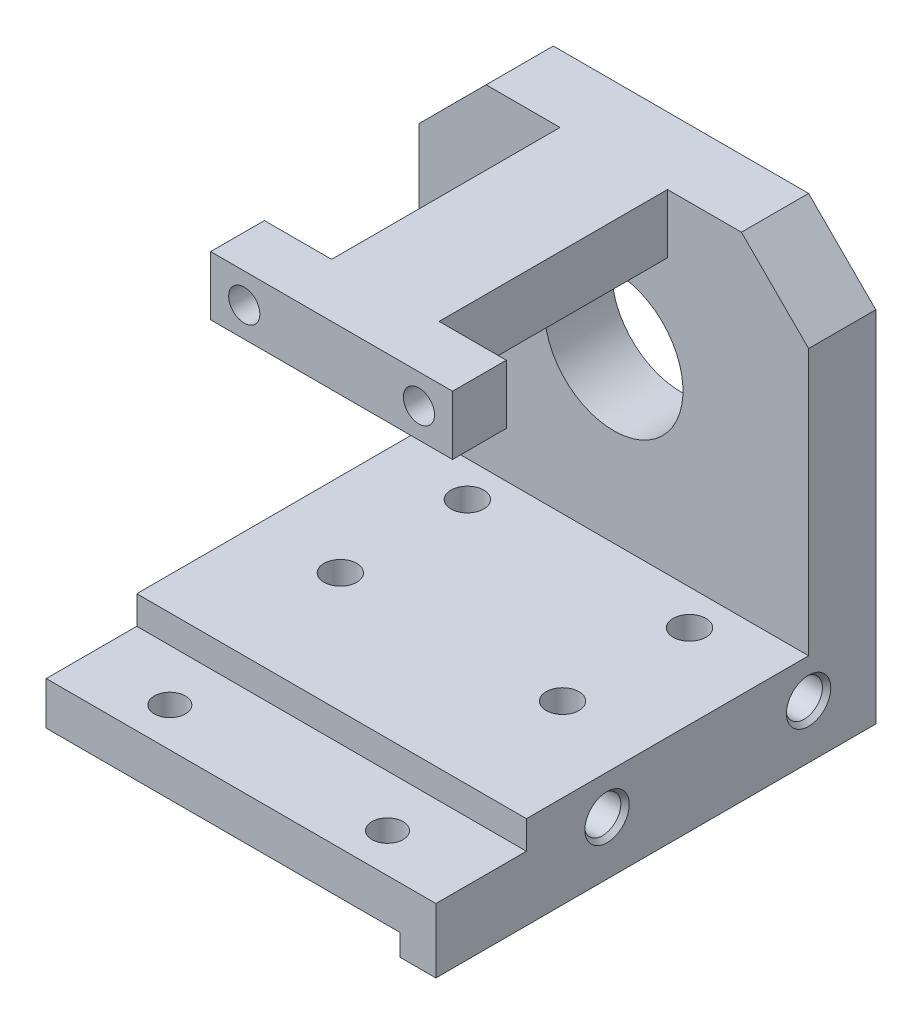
ISO-10303-21;
HEADER;
FILE_DESCRIPTION(('STEP AP214'),'2;1');
FILE_NAME('part.step','',(''),(''),'','','');
FILE_SCHEMA(('AUTOMOTIVE_DESIGN { 1 0 10303 214 1 1 1 1 }'));
ENDSEC;
DATA;
#1=APPLICATION_CONTEXT('core data for automotive mechanical design processes');
#2=APPLICATION_PROTOCOL_DEFINITION('international standard','automotive_design',2000,#1);
#3=PRODUCT_CONTEXT('',#1,'mechanical');
#4=PRODUCT('Part','Part','',(#3));
#5=PRODUCT_RELATED_PRODUCT_CATEGORY('part','',(#4));
#6=PRODUCT_DEFINITION_FORMATION('','',#4);
#7=PRODUCT_DEFINITION_CONTEXT('part definition',#1,'design');
#8=PRODUCT_DEFINITION('design','',#6,#7);
#9=PRODUCT_DEFINITION_SHAPE('','',#8);
#10=(LENGTH_UNIT() NAMED_UNIT(*) SI_UNIT(.MILLI.,.METRE.));
#11=(NAMED_UNIT(*) PLANE_ANGLE_UNIT() SI_UNIT($,.RADIAN.));
#12=(NAMED_UNIT(*) SI_UNIT($,.STERADIAN.) SOLID_ANGLE_UNIT());
#13=UNCERTAINTY_MEASURE_WITH_UNIT(LENGTH_MEASURE(1.E-05),#10,'distance_accuracy_value','');
#14=(GEOMETRIC_REPRESENTATION_CONTEXT(3) GLOBAL_UNCERTAINTY_ASSIGNED_CONTEXT((#13)) GLOBAL_UNIT_ASSIGNED_CONTEXT((#10,
#11,#12)) REPRESENTATION_CONTEXT('',''));
#15=CARTESIAN_POINT('',(0.,0.,0.));
#16=DIRECTION('',(0.,0.,1.));
#17=DIRECTION('',(1.,0.,0.));
#18=AXIS2_PLACEMENT_3D('',#15,#16,#17);
#19=CARTESIAN_POINT('',(0.,0.,0.254000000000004));
#20=DIRECTION('',(0.,0.,-1.));
#21=DIRECTION('',(-1.,0.,0.));
#22=AXIS2_PLACEMENT_3D('',#19,#20,#21);
#23=PLANE('',#22);
#24=CARTESIAN_POINT('',(0.,0.,0.254000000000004));
#25=DIRECTION('',(0.,0.,-1.));
#26=DIRECTION('',(-1.,0.,0.));
#27=AXIS2_PLACEMENT_3D('',#24,#25,#26);
#28=CIRCLE('',#27,13.97);
#29=CARTESIAN_POINT('',(-13.97,0.,0.254000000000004));
#30=VERTEX_POINT('',#29);
#31=EDGE_CURVE('E906',#30,#30,#28,.T.);
#32=ORIENTED_EDGE('',*,*,#31,.T.);
#33=EDGE_LOOP('',(#32));
#34=FACE_BOUND('',#33,.T.);
#35=CARTESIAN_POINT('',(0.,0.,0.254000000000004));
#36=DIRECTION('',(0.,0.,-1.));
#37=DIRECTION('',(-1.,0.,0.));
#38=AXIS2_PLACEMENT_3D('',#35,#36,#37);
#39=CIRCLE('',#38,7.9375);
#40=CARTESIAN_POINT('',(-7.9375,0.,0.254000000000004));
#41=VERTEX_POINT('',#40);
#42=EDGE_CURVE('E912',#41,#41,#39,.T.);
#43=ORIENTED_EDGE('',*,*,#42,.F.);
#44=EDGE_LOOP('',(#43));
#45=FACE_BOUND('',#44,.T.);
#46=ADVANCED_FACE('F37',(#34,#45),#23,.T.);
#47=CARTESIAN_POINT('',(0.,0.,6.35));
#48=DIRECTION('',(0.,0.,-1.));
#49=DIRECTION('',(-1.,0.,0.));
#50=AXIS2_PLACEMENT_3D('',#47,#48,#49);
#51=CYLINDRICAL_SURFACE('',#50,6.5405);
#52=CARTESIAN_POINT('',(0.,0.,6.35));
#53=DIRECTION('',(0.,0.,-1.));
#54=DIRECTION('',(-1.,0.,0.));
#55=AXIS2_PLACEMENT_3D('',#52,#53,#54);
#56=CIRCLE('',#55,6.5405);
#57=CARTESIAN_POINT('',(-6.5405,0.,6.35));
#58=VERTEX_POINT('',#57);
#59=EDGE_CURVE('E222',#58,#58,#56,.T.);
#60=ORIENTED_EDGE('',*,*,#59,.F.);
#61=EDGE_LOOP('',(#60));
#62=FACE_BOUND('',#61,.T.);
#63=CARTESIAN_POINT('',(0.,0.,0.));
#64=DIRECTION('',(0.,0.,-1.));
#65=DIRECTION('',(-1.,0.,0.));
#66=AXIS2_PLACEMENT_3D('',#63,#64,#65);
#67=CIRCLE('',#66,6.5405);
#68=CARTESIAN_POINT('',(-6.5405,0.,0.));
#69=VERTEX_POINT('',#68);
#70=EDGE_CURVE('E915',#69,#69,#67,.T.);
#71=ORIENTED_EDGE('',*,*,#70,.T.);
#72=EDGE_LOOP('',(#71));
#73=FACE_BOUND('',#72,.T.);
#74=ADVANCED_FACE('F430',(#62,#73),#51,.F.);
#75=CARTESIAN_POINT('',(-5.08,15.748,44.6153156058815));
#76=DIRECTION('',(1.,0.,0.));
#77=DIRECTION('',(0.,1.,0.));
#78=AXIS2_PLACEMENT_3D('',#75,#76,#77);
#79=PLANE('',#78);
#80=DIRECTION('',(0.,-1.,0.));
#81=VECTOR('',#80,1.);
#82=CARTESIAN_POINT('',(-5.08,15.748,27.94));
#83=LINE('',#82,#81);
#84=CARTESIAN_POINT('',(-5.08,15.748,27.94));
#85=VERTEX_POINT('',#84);
#86=CARTESIAN_POINT('',(-5.08,10.16,27.94));
#87=VERTEX_POINT('',#86);
#88=EDGE_CURVE('E368',#85,#87,#83,.T.);
#89=ORIENTED_EDGE('',*,*,#88,.F.);
#90=DIRECTION('',(0.,0.,-1.));
#91=VECTOR('',#90,1.);
#92=CARTESIAN_POINT('',(-5.08,15.748,44.6153156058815));
#93=LINE('',#92,#91);
#94=CARTESIAN_POINT('',(-5.08,15.748,6.34999999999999));
#95=VERTEX_POINT('',#94);
#96=EDGE_CURVE('E395',#85,#95,#93,.T.);
#97=ORIENTED_EDGE('',*,*,#96,.T.);
#98=DIRECTION('',(0.,-1.,0.));
#99=VECTOR('',#98,1.);
#100=CARTESIAN_POINT('',(-5.08,15.748,6.34999999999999));
#101=LINE('',#100,#99);
#102=CARTESIAN_POINT('',(-5.08,10.16,6.35));
#103=VERTEX_POINT('',#102);
#104=EDGE_CURVE('E285',#95,#103,#101,.T.);
#105=ORIENTED_EDGE('',*,*,#104,.T.);
#106=DIRECTION('',(0.,0.,-1.));
#107=VECTOR('',#106,1.);
#108=CARTESIAN_POINT('',(-5.08,10.16,44.6153156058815));
#109=LINE('',#108,#107);
#110=EDGE_CURVE('E400',#87,#103,#109,.T.);
#111=ORIENTED_EDGE('',*,*,#110,.F.);
#112=EDGE_LOOP('',(#89,#97,#105,#111));
#113=FACE_BOUND('',#112,.T.);
#114=ADVANCED_FACE('F428',(#113),#79,.F.);
#115=CARTESIAN_POINT('',(-18.415,15.748,6.34999999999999));
#116=DIRECTION('',(0.,0.,1.));
#117=DIRECTION('',(1.,0.,0.));
#118=AXIS2_PLACEMENT_3D('',#115,#116,#117);
#119=PLANE('',#118);
#120=ORIENTED_EDGE('',*,*,#59,.T.);
#121=EDGE_LOOP('',(#120));
#122=FACE_BOUND('',#121,.T.);
#123=DIRECTION('',(0.,1.,0.));
#124=VECTOR('',#123,1.);
#125=CARTESIAN_POINT('',(18.415,15.748,6.35));
#126=LINE('',#125,#124);
#127=CARTESIAN_POINT('',(18.415,-15.748,6.34999999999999));
#128=VERTEX_POINT('',#127);
#129=CARTESIAN_POINT('',(18.415,9.39799999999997,6.34999999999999));
#130=VERTEX_POINT('',#129);
#131=EDGE_CURVE('E229',#128,#130,#126,.T.);
#132=ORIENTED_EDGE('',*,*,#131,.T.);
#133=DIRECTION('',(0.707106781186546,-0.707106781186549,0.));
#134=VECTOR('',#133,1.);
#135=CARTESIAN_POINT('',(-3.17499999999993,30.988,6.34999999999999));
#136=LINE('',#135,#134);
#137=CARTESIAN_POINT('',(12.065,15.748,6.35));
#138=VERTEX_POINT('',#137);
#139=EDGE_CURVE('E290',#130,#138,#136,.F.);
#140=ORIENTED_EDGE('',*,*,#139,.T.);
#141=DIRECTION('',(-1.,0.,0.));
#142=VECTOR('',#141,1.);
#143=CARTESIAN_POINT('',(-18.415,15.748,6.34999999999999));
#144=LINE('',#143,#142);
#145=CARTESIAN_POINT('',(5.08,15.748,6.35));
#146=VERTEX_POINT('',#145);
#147=EDGE_CURVE('E274',#138,#146,#144,.T.);
#148=ORIENTED_EDGE('',*,*,#147,.T.);
#149=DIRECTION('',(0.,1.,0.));
#150=VECTOR('',#149,1.);
#151=CARTESIAN_POINT('',(5.08,15.748,6.35));
#152=LINE('',#151,#150);
#153=CARTESIAN_POINT('',(5.08,10.16,6.34999999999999));
#154=VERTEX_POINT('',#153);
#155=EDGE_CURVE('E392',#154,#146,#152,.T.);
#156=ORIENTED_EDGE('',*,*,#155,.F.);
#157=DIRECTION('',(1.,0.,0.));
#158=VECTOR('',#157,1.);
#159=CARTESIAN_POINT('',(-5.08,10.16,6.35));
#160=LINE('',#159,#158);
#161=EDGE_CURVE('E389',#103,#154,#160,.T.);
#162=ORIENTED_EDGE('',*,*,#161,.F.);
#163=ORIENTED_EDGE('',*,*,#104,.F.);
#164=CARTESIAN_POINT('',(-12.065,15.748,6.34999999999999));
#165=VERTEX_POINT('',#164);
#166=EDGE_CURVE('E266',#95,#165,#144,.T.);
#167=ORIENTED_EDGE('',*,*,#166,.T.);
#168=DIRECTION('',(0.707106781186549,0.707106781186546,0.));
#169=VECTOR('',#168,1.);
#170=CARTESIAN_POINT('',(-15.24,12.573,6.34999999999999));
#171=LINE('',#170,#169);
#172=CARTESIAN_POINT('',(-18.415,9.39799999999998,6.35));
#173=VERTEX_POINT('',#172);
#174=EDGE_CURVE('E61',#165,#173,#171,.F.);
#175=ORIENTED_EDGE('',*,*,#174,.T.);
#176=DIRECTION('',(0.,-1.,0.));
#177=VECTOR('',#176,1.);
#178=CARTESIAN_POINT('',(-18.415,15.748,6.34999999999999));
#179=LINE('',#178,#177);
#180=CARTESIAN_POINT('',(-18.415,-15.748,6.35));
#181=VERTEX_POINT('',#180);
#182=EDGE_CURVE('E258',#173,#181,#179,.T.);
#183=ORIENTED_EDGE('',*,*,#182,.T.);
#184=DIRECTION('',(-1.,0.,0.));
#185=VECTOR('',#184,1.);
#186=CARTESIAN_POINT('',(-18.415,-15.748,6.35));
#187=LINE('',#186,#185);
#188=EDGE_CURVE('E219',#128,#181,#187,.T.);
#189=ORIENTED_EDGE('',*,*,#188,.F.);
#190=EDGE_LOOP('',(#132,#140,#148,#156,#162,#163,#167,#175,#183,#189));
#191=FACE_BOUND('',#190,.T.);
#192=ADVANCED_FACE('F282',(#122,#191),#119,.T.);
#193=CARTESIAN_POINT('',(-18.415,-22.479,6.34999999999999));
#194=DIRECTION('',(0.,1.,0.));
#195=DIRECTION('',(-1.,0.,0.));
#196=AXIS2_PLACEMENT_3D('',#193,#194,#195);
#197=PLANE('',#196);
#198=CARTESIAN_POINT('',(10.500000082,-22.479,9.689999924));
#199=DIRECTION('',(0.,1.,0.));
#200=DIRECTION('',(-1.,0.,0.));
#201=AXIS2_PLACEMENT_3D('',#198,#199,#200);
#202=CIRCLE('',#201,1.54999999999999);
#203=CARTESIAN_POINT('',(8.95000008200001,-22.479,9.689999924));
#204=VERTEX_POINT('',#203);
#205=EDGE_CURVE('E855',#204,#204,#202,.T.);
#206=ORIENTED_EDGE('',*,*,#205,.T.);
#207=EDGE_LOOP('',(#206));
#208=FACE_BOUND('',#207,.T.);
#209=CARTESIAN_POINT('',(-10.500000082,-22.479,9.68999992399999));
#210=DIRECTION('',(0.,1.,0.));
#211=DIRECTION('',(-1.,0.,0.));
#212=AXIS2_PLACEMENT_3D('',#209,#210,#211);
#213=CIRCLE('',#212,1.54999999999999);
#214=CARTESIAN_POINT('',(-12.050000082,-22.479,9.68999992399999));
#215=VERTEX_POINT('',#214);
#216=EDGE_CURVE('E861',#215,#215,#213,.T.);
#217=ORIENTED_EDGE('',*,*,#216,.T.);
#218=EDGE_LOOP('',(#217));
#219=FACE_BOUND('',#218,.T.);
#220=CARTESIAN_POINT('',(-10.500000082,-22.479,21.690000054));
#221=DIRECTION('',(0.,1.,0.));
#222=DIRECTION('',(-1.,0.,0.));
#223=AXIS2_PLACEMENT_3D('',#220,#221,#222);
#224=CIRCLE('',#223,1.54999999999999);
#225=CARTESIAN_POINT('',(-12.050000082,-22.479,21.690000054));
#226=VERTEX_POINT('',#225);
#227=EDGE_CURVE('E325',#226,#226,#224,.T.);
#228=ORIENTED_EDGE('',*,*,#227,.T.);
#229=EDGE_LOOP('',(#228));
#230=FACE_BOUND('',#229,.T.);
#231=CARTESIAN_POINT('',(10.500000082,-22.479,21.690000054));
#232=DIRECTION('',(0.,1.,0.));
#233=DIRECTION('',(-1.,0.,0.));
#234=AXIS2_PLACEMENT_3D('',#231,#232,#233);
#235=CIRCLE('',#234,1.54999999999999);
#236=CARTESIAN_POINT('',(8.95000008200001,-22.479,21.690000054));
#237=VERTEX_POINT('',#236);
#238=EDGE_CURVE('E315',#237,#237,#235,.T.);
#239=ORIENTED_EDGE('',*,*,#238,.T.);
#240=EDGE_LOOP('',(#239));
#241=FACE_BOUND('',#240,.T.);
#242=CARTESIAN_POINT('',(10.16,-22.479,37.8943997));
#243=DIRECTION('',(0.,-1.,0.));
#244=DIRECTION('',(0.,0.,-1.));
#245=AXIS2_PLACEMENT_3D('',#242,#243,#244);
#246=CIRCLE('',#245,1.4732);
#247=CARTESIAN_POINT('',(10.16,-22.479,36.4211997));
#248=VERTEX_POINT('',#247);
#249=EDGE_CURVE('E317',#248,#248,#246,.T.);
#250=ORIENTED_EDGE('',*,*,#249,.F.);
#251=EDGE_LOOP('',(#250));
#252=FACE_BOUND('',#251,.T.);
#253=CARTESIAN_POINT('',(-10.414,-22.479,37.8943997));
#254=DIRECTION('',(0.,-1.,0.));
#255=DIRECTION('',(0.,0.,-1.));
#256=AXIS2_PLACEMENT_3D('',#253,#254,#255);
#257=CIRCLE('',#256,1.4732);
#258=CARTESIAN_POINT('',(-10.414,-22.479,36.4211997));
#259=VERTEX_POINT('',#258);
#260=EDGE_CURVE('E314',#259,#259,#257,.T.);
#261=ORIENTED_EDGE('',*,*,#260,.F.);
#262=EDGE_LOOP('',(#261));
#263=FACE_BOUND('',#262,.T.);
#264=DIRECTION('',(0.,0.,-1.));
#265=VECTOR('',#264,1.);
#266=CARTESIAN_POINT('',(14.999999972,-22.479,0.));
#267=LINE('',#266,#265);
#268=CARTESIAN_POINT('',(14.999999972,-22.479,41.5773997));
#269=VERTEX_POINT('',#268);
#270=CARTESIAN_POINT('',(14.999999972,-22.479,0.));
#271=VERTEX_POINT('',#270);
#272=EDGE_CURVE('E41',#269,#271,#267,.T.);
#273=ORIENTED_EDGE('',*,*,#272,.F.);
#274=DIRECTION('',(-1.,0.,0.));
#275=VECTOR('',#274,1.);
#276=CARTESIAN_POINT('',(-18.415,-22.479,41.5773997));
#277=LINE('',#276,#275);
#278=CARTESIAN_POINT('',(-18.415,-22.479,41.5773997));
#279=VERTEX_POINT('',#278);
#280=EDGE_CURVE('E849',#269,#279,#277,.T.);
#281=ORIENTED_EDGE('',*,*,#280,.T.);
#282=DIRECTION('',(0.,0.,1.));
#283=VECTOR('',#282,1.);
#284=CARTESIAN_POINT('',(-18.415,-22.479,6.34999999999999));
#285=LINE('',#284,#283);
#286=CARTESIAN_POINT('',(-18.415,-22.479,0.));
#287=VERTEX_POINT('',#286);
#288=EDGE_CURVE('E313',#287,#279,#285,.T.);
#289=ORIENTED_EDGE('',*,*,#288,.F.);
#290=DIRECTION('',(1.,0.,0.));
#291=VECTOR('',#290,1.);
#292=CARTESIAN_POINT('',(-18.415,-22.479,0.));
#293=LINE('',#292,#291);
#294=EDGE_CURVE('E244',#287,#271,#293,.T.);
#295=ORIENTED_EDGE('',*,*,#294,.T.);
#296=EDGE_LOOP('',(#273,#281,#289,#295));
#297=FACE_BOUND('',#296,.T.);
#298=ADVANCED_FACE('F436',(#208,#219,#230,#241,#252,#263,#297),#197,.F.);
#299=CARTESIAN_POINT('',(-18.415,15.748,0.));
#300=DIRECTION('',(0.,0.,1.));
#301=DIRECTION('',(1.,0.,0.));
#302=AXIS2_PLACEMENT_3D('',#299,#300,#301);
#303=PLANE('',#302);
#304=CARTESIAN_POINT('',(0.,0.,0.));
#305=DIRECTION('',(0.,0.,-1.));
#306=DIRECTION('',(-1.,0.,0.));
#307=AXIS2_PLACEMENT_3D('',#304,#305,#306);
#308=CIRCLE('',#307,13.97);
#309=CARTESIAN_POINT('',(-13.97,0.,0.));
#310=VERTEX_POINT('',#309);
#311=EDGE_CURVE('E907',#310,#310,#308,.T.);
#312=ORIENTED_EDGE('',*,*,#311,.F.);
#313=EDGE_LOOP('',(#312));
#314=FACE_BOUND('',#313,.T.);
#315=ORIENTED_EDGE('',*,*,#294,.F.);
#316=DIRECTION('',(0.,-1.,0.));
#317=VECTOR('',#316,1.);
#318=CARTESIAN_POINT('',(-18.415,15.748,0.));
#319=LINE('',#318,#317);
#320=CARTESIAN_POINT('',(-18.415,9.39799999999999,0.));
#321=VERTEX_POINT('',#320);
#322=EDGE_CURVE('E249',#321,#287,#319,.T.);
#323=ORIENTED_EDGE('',*,*,#322,.F.);
#324=DIRECTION('',(-0.707106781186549,-0.707106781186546,0.));
#325=VECTOR('',#324,1.);
#326=CARTESIAN_POINT('',(-18.415,9.39799999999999,0.));
#327=LINE('',#326,#325);
#328=CARTESIAN_POINT('',(-12.065,15.748,0.));
#329=VERTEX_POINT('',#328);
#330=EDGE_CURVE('E294',#321,#329,#327,.F.);
#331=ORIENTED_EDGE('',*,*,#330,.T.);
#332=DIRECTION('',(-1.,0.,0.));
#333=VECTOR('',#332,1.);
#334=CARTESIAN_POINT('',(-18.415,15.748,0.));
#335=LINE('',#334,#333);
#336=CARTESIAN_POINT('',(12.065,15.748,0.));
#337=VERTEX_POINT('',#336);
#338=EDGE_CURVE('E256',#337,#329,#335,.T.);
#339=ORIENTED_EDGE('',*,*,#338,.F.);
#340=DIRECTION('',(-0.707106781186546,0.707106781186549,0.));
#341=VECTOR('',#340,1.);
#342=CARTESIAN_POINT('',(12.065,15.748,0.));
#343=LINE('',#342,#341);
#344=CARTESIAN_POINT('',(18.415,9.39799999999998,0.));
#345=VERTEX_POINT('',#344);
#346=EDGE_CURVE('E291',#337,#345,#343,.F.);
#347=ORIENTED_EDGE('',*,*,#346,.T.);
#348=DIRECTION('',(0.,1.,0.));
#349=VECTOR('',#348,1.);
#350=CARTESIAN_POINT('',(18.415,15.748,0.));
#351=LINE('',#350,#349);
#352=CARTESIAN_POINT('',(18.415,-24.511,0.));
#353=VERTEX_POINT('',#352);
#354=EDGE_CURVE('E248',#353,#345,#351,.T.);
#355=ORIENTED_EDGE('',*,*,#354,.F.);
#356=DIRECTION('',(1.,0.,0.));
#357=VECTOR('',#356,1.);
#358=CARTESIAN_POINT('',(18.415,-24.511,0.));
#359=LINE('',#358,#357);
#360=CARTESIAN_POINT('',(14.999999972,-24.511,0.));
#361=VERTEX_POINT('',#360);
#362=EDGE_CURVE('E194',#361,#353,#359,.T.);
#363=ORIENTED_EDGE('',*,*,#362,.F.);
#364=DIRECTION('',(0.,1.,0.));
#365=VECTOR('',#364,1.);
#366=CARTESIAN_POINT('',(14.999999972,-24.511,0.));
#367=LINE('',#366,#365);
#368=EDGE_CURVE('E203',#361,#271,#367,.T.);
#369=ORIENTED_EDGE('',*,*,#368,.T.);
#370=EDGE_LOOP('',(#315,#323,#331,#339,#347,#355,#363,#369));
#371=FACE_BOUND('',#370,.T.);
#372=ADVANCED_FACE('F302',(#314,#371),#303,.F.);
#373=CARTESIAN_POINT('',(-18.415,15.748,6.34999999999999));
#374=DIRECTION('',(1.,0.,0.));
#375=DIRECTION('',(0.,1.,0.));
#376=AXIS2_PLACEMENT_3D('',#373,#374,#375);
#377=PLANE('',#376);
#378=ORIENTED_EDGE('',*,*,#288,.T.);
#379=DIRECTION('',(0.,-1.,0.));
#380=VECTOR('',#379,1.);
#381=CARTESIAN_POINT('',(-18.415,-18.415,41.5773997));
#382=LINE('',#381,#380);
#383=CARTESIAN_POINT('',(-18.415,-18.415,41.5773997));
#384=VERTEX_POINT('',#383);
#385=EDGE_CURVE('E842',#384,#279,#382,.T.);
#386=ORIENTED_EDGE('',*,*,#385,.F.);
#387=DIRECTION('',(0.,0.,1.));
#388=VECTOR('',#387,1.);
#389=CARTESIAN_POINT('',(-18.415,-18.415,43.18));
#390=LINE('',#389,#388);
#391=CARTESIAN_POINT('',(-18.415,-18.415,33.02));
#392=VERTEX_POINT('',#391);
#393=EDGE_CURVE('E209',#392,#384,#390,.T.);
#394=ORIENTED_EDGE('',*,*,#393,.F.);
#395=DIRECTION('',(0.,-1.,0.));
#396=VECTOR('',#395,1.);
#397=CARTESIAN_POINT('',(-18.415,-15.748,33.02));
#398=LINE('',#397,#396);
#399=CARTESIAN_POINT('',(-18.415,-15.748,33.02));
#400=VERTEX_POINT('',#399);
#401=EDGE_CURVE('E206',#400,#392,#398,.T.);
#402=ORIENTED_EDGE('',*,*,#401,.F.);
#403=DIRECTION('',(0.,0.,-1.));
#404=VECTOR('',#403,1.);
#405=CARTESIAN_POINT('',(-18.415,-15.748,43.18));
#406=LINE('',#405,#404);
#407=EDGE_CURVE('E228',#400,#181,#406,.T.);
#408=ORIENTED_EDGE('',*,*,#407,.T.);
#409=ORIENTED_EDGE('',*,*,#182,.F.);
#410=DIRECTION('',(0.,0.,-1.));
#411=VECTOR('',#410,1.);
#412=CARTESIAN_POINT('',(-18.415,9.39799999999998,6.35));
#413=LINE('',#412,#411);
#414=EDGE_CURVE('E47',#173,#321,#413,.T.);
#415=ORIENTED_EDGE('',*,*,#414,.T.);
#416=ORIENTED_EDGE('',*,*,#322,.T.);
#417=EDGE_LOOP('',(#378,#386,#394,#402,#408,#409,#415,#416));
#418=FACE_BOUND('',#417,.T.);
#419=ADVANCED_FACE('F307',(#418),#377,.F.);
#420=CARTESIAN_POINT('',(18.415,15.748,6.35));
#421=DIRECTION('',(-1.,0.,0.));
#422=DIRECTION('',(0.,-1.,0.));
#423=AXIS2_PLACEMENT_3D('',#420,#421,#422);
#424=PLANE('',#423);
#425=CARTESIAN_POINT('',(18.415,-19.431,6.34999999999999));
#426=DIRECTION('',(1.,0.,0.));
#427=DIRECTION('',(0.,0.,-1.));
#428=AXIS2_PLACEMENT_3D('',#425,#426,#427);
#429=CIRCLE('',#428,2.0955);
#430=CARTESIAN_POINT('',(18.415,-19.431,4.25449999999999));
#431=VERTEX_POINT('',#430);
#432=EDGE_CURVE('E897',#431,#431,#429,.T.);
#433=ORIENTED_EDGE('',*,*,#432,.F.);
#434=EDGE_LOOP('',(#433));
#435=FACE_BOUND('',#434,.T.);
#436=CARTESIAN_POINT('',(18.415,-19.431,25.4));
#437=DIRECTION('',(1.,0.,0.));
#438=DIRECTION('',(0.,0.,-1.));
#439=AXIS2_PLACEMENT_3D('',#436,#437,#438);
#440=CIRCLE('',#439,2.0955);
#441=CARTESIAN_POINT('',(18.415,-19.431,23.3045));
#442=VERTEX_POINT('',#441);
#443=EDGE_CURVE('E189',#442,#442,#440,.T.);
#444=ORIENTED_EDGE('',*,*,#443,.F.);
#445=EDGE_LOOP('',(#444));
#446=FACE_BOUND('',#445,.T.);
#447=DIRECTION('',(0.,0.,1.));
#448=VECTOR('',#447,1.);
#449=CARTESIAN_POINT('',(18.415,-18.415,6.34999999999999));
#450=LINE('',#449,#448);
#451=CARTESIAN_POINT('',(18.415,-18.415,33.02));
#452=VERTEX_POINT('',#451);
#453=CARTESIAN_POINT('',(18.415,-18.415,41.5773997));
#454=VERTEX_POINT('',#453);
#455=EDGE_CURVE('E187',#452,#454,#450,.T.);
#456=ORIENTED_EDGE('',*,*,#455,.T.);
#457=DIRECTION('',(0.,1.,0.));
#458=VECTOR('',#457,1.);
#459=CARTESIAN_POINT('',(18.415,-18.415,41.5773997));
#460=LINE('',#459,#458);
#461=CARTESIAN_POINT('',(18.415,-24.511,41.5773997));
#462=VERTEX_POINT('',#461);
#463=EDGE_CURVE('E175',#462,#454,#460,.T.);
#464=ORIENTED_EDGE('',*,*,#463,.F.);
#465=DIRECTION('',(0.,0.,1.));
#466=VECTOR('',#465,1.);
#467=CARTESIAN_POINT('',(18.415,-24.511,0.));
#468=LINE('',#467,#466);
#469=EDGE_CURVE('E185',#353,#462,#468,.T.);
#470=ORIENTED_EDGE('',*,*,#469,.F.);
#471=ORIENTED_EDGE('',*,*,#354,.T.);
#472=DIRECTION('',(0.,0.,1.));
#473=VECTOR('',#472,1.);
#474=CARTESIAN_POINT('',(18.415,9.39799999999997,6.34999999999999));
#475=LINE('',#474,#473);
#476=EDGE_CURVE('E269',#345,#130,#475,.T.);
#477=ORIENTED_EDGE('',*,*,#476,.T.);
#478=ORIENTED_EDGE('',*,*,#131,.F.);
#479=DIRECTION('',(0.,0.,-1.));
#480=VECTOR('',#479,1.);
#481=CARTESIAN_POINT('',(18.415,-15.748,43.18));
#482=LINE('',#481,#480);
#483=CARTESIAN_POINT('',(18.415,-15.748,33.02));
#484=VERTEX_POINT('',#483);
#485=EDGE_CURVE('E238',#484,#128,#482,.T.);
#486=ORIENTED_EDGE('',*,*,#485,.F.);
#487=DIRECTION('',(0.,-1.,0.));
#488=VECTOR('',#487,1.);
#489=CARTESIAN_POINT('',(18.415,15.748,33.02));
#490=LINE('',#489,#488);
#491=EDGE_CURVE('E217',#484,#452,#490,.T.);
#492=ORIENTED_EDGE('',*,*,#491,.T.);
#493=EDGE_LOOP('',(#456,#464,#470,#471,#477,#478,#486,#492));
#494=FACE_BOUND('',#493,.T.);
#495=ADVANCED_FACE('F183',(#435,#446,#494),#424,.F.);
#496=CARTESIAN_POINT('',(-18.415,15.748,6.34999999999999));
#497=DIRECTION('',(0.,-1.,0.));
#498=DIRECTION('',(1.,0.,0.));
#499=AXIS2_PLACEMENT_3D('',#496,#497,#498);
#500=PLANE('',#499);
#501=ORIENTED_EDGE('',*,*,#147,.F.);
#502=DIRECTION('',(0.,0.,-1.));
#503=VECTOR('',#502,1.);
#504=CARTESIAN_POINT('',(12.065,15.748,6.35));
#505=LINE('',#504,#503);
#506=EDGE_CURVE('E279',#138,#337,#505,.T.);
#507=ORIENTED_EDGE('',*,*,#506,.T.);
#508=ORIENTED_EDGE('',*,*,#338,.T.);
#509=DIRECTION('',(0.,0.,1.));
#510=VECTOR('',#509,1.);
#511=CARTESIAN_POINT('',(-12.065,15.748,6.34999999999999));
#512=LINE('',#511,#510);
#513=EDGE_CURVE('E275',#329,#165,#512,.T.);
#514=ORIENTED_EDGE('',*,*,#513,.T.);
#515=ORIENTED_EDGE('',*,*,#166,.F.);
#516=ORIENTED_EDGE('',*,*,#96,.F.);
#517=DIRECTION('',(1.,0.,0.));
#518=VECTOR('',#517,1.);
#519=CARTESIAN_POINT('',(-11.43,15.748,27.94));
#520=LINE('',#519,#518);
#521=CARTESIAN_POINT('',(-11.43,15.748,27.94));
#522=VERTEX_POINT('',#521);
#523=EDGE_CURVE('E384',#522,#85,#520,.T.);
#524=ORIENTED_EDGE('',*,*,#523,.F.);
#525=DIRECTION('',(0.,0.,-1.));
#526=VECTOR('',#525,1.);
#527=CARTESIAN_POINT('',(-11.43,15.748,33.02));
#528=LINE('',#527,#526);
#529=CARTESIAN_POINT('',(-11.43,15.748,33.02));
#530=VERTEX_POINT('',#529);
#531=EDGE_CURVE('E372',#530,#522,#528,.T.);
#532=ORIENTED_EDGE('',*,*,#531,.F.);
#533=DIRECTION('',(1.,0.,0.));
#534=VECTOR('',#533,1.);
#535=CARTESIAN_POINT('',(-5.08,15.748,33.02));
#536=LINE('',#535,#534);
#537=CARTESIAN_POINT('',(11.43,15.748,33.02));
#538=VERTEX_POINT('',#537);
#539=EDGE_CURVE('E200',#530,#538,#536,.T.);
#540=ORIENTED_EDGE('',*,*,#539,.T.);
#541=DIRECTION('',(0.,0.,-1.));
#542=VECTOR('',#541,1.);
#543=CARTESIAN_POINT('',(11.43,15.748,33.02));
#544=LINE('',#543,#542);
#545=CARTESIAN_POINT('',(11.43,15.748,27.94));
#546=VERTEX_POINT('',#545);
#547=EDGE_CURVE('E358',#538,#546,#544,.T.);
#548=ORIENTED_EDGE('',*,*,#547,.T.);
#549=DIRECTION('',(-1.,0.,0.));
#550=VECTOR('',#549,1.);
#551=CARTESIAN_POINT('',(11.43,15.748,27.94));
#552=LINE('',#551,#550);
#553=CARTESIAN_POINT('',(5.08,15.748,27.94));
#554=VERTEX_POINT('',#553);
#555=EDGE_CURVE('E361',#546,#554,#552,.T.);
#556=ORIENTED_EDGE('',*,*,#555,.T.);
#557=DIRECTION('',(0.,0.,-1.));
#558=VECTOR('',#557,1.);
#559=CARTESIAN_POINT('',(5.08,15.748,44.6153156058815));
#560=LINE('',#559,#558);
#561=EDGE_CURVE('E397',#554,#146,#560,.T.);
#562=ORIENTED_EDGE('',*,*,#561,.T.);
#563=EDGE_LOOP('',(#501,#507,#508,#514,#515,#516,#524,#532,#540,#548,#556,#562));
#564=FACE_BOUND('',#563,.T.);
#565=ADVANCED_FACE('F299',(#564),#500,.F.);
#566=CARTESIAN_POINT('',(-18.415,-15.748,43.18));
#567=DIRECTION('',(0.,-1.,0.));
#568=DIRECTION('',(0.,0.,-1.));
#569=AXIS2_PLACEMENT_3D('',#566,#567,#568);
#570=PLANE('',#569);
#571=CARTESIAN_POINT('',(10.500000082,-15.748,9.689999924));
#572=DIRECTION('',(0.,1.,0.));
#573=DIRECTION('',(0.,0.,1.));
#574=AXIS2_PLACEMENT_3D('',#571,#572,#573);
#575=CIRCLE('',#574,1.54999999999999);
#576=CARTESIAN_POINT('',(10.500000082,-15.748,11.239999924));
#577=VERTEX_POINT('',#576);
#578=EDGE_CURVE('E852',#577,#577,#575,.T.);
#579=ORIENTED_EDGE('',*,*,#578,.F.);
#580=EDGE_LOOP('',(#579));
#581=FACE_BOUND('',#580,.T.);
#582=CARTESIAN_POINT('',(-10.500000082,-15.748,9.689999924));
#583=DIRECTION('',(0.,1.,0.));
#584=DIRECTION('',(0.,0.,1.));
#585=AXIS2_PLACEMENT_3D('',#582,#583,#584);
#586=CIRCLE('',#585,1.54999999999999);
#587=CARTESIAN_POINT('',(-10.500000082,-15.748,11.239999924));
#588=VERTEX_POINT('',#587);
#589=EDGE_CURVE('E858',#588,#588,#586,.T.);
#590=ORIENTED_EDGE('',*,*,#589,.F.);
#591=EDGE_LOOP('',(#590));
#592=FACE_BOUND('',#591,.T.);
#593=CARTESIAN_POINT('',(-10.500000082,-15.748,21.690000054));
#594=DIRECTION('',(0.,1.,0.));
#595=DIRECTION('',(0.,0.,1.));
#596=AXIS2_PLACEMENT_3D('',#593,#594,#595);
#597=CIRCLE('',#596,1.54999999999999);
#598=CARTESIAN_POINT('',(-10.500000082,-15.748,23.240000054));
#599=VERTEX_POINT('',#598);
#600=EDGE_CURVE('E330',#599,#599,#597,.T.);
#601=ORIENTED_EDGE('',*,*,#600,.F.);
#602=EDGE_LOOP('',(#601));
#603=FACE_BOUND('',#602,.T.);
#604=CARTESIAN_POINT('',(10.500000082,-15.748,21.690000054));
#605=DIRECTION('',(0.,1.,0.));
#606=DIRECTION('',(0.,0.,1.));
#607=AXIS2_PLACEMENT_3D('',#604,#605,#606);
#608=CIRCLE('',#607,1.54999999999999);
#609=CARTESIAN_POINT('',(10.500000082,-15.748,23.240000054));
#610=VERTEX_POINT('',#609);
#611=EDGE_CURVE('E318',#610,#610,#608,.T.);
#612=ORIENTED_EDGE('',*,*,#611,.F.);
#613=EDGE_LOOP('',(#612));
#614=FACE_BOUND('',#613,.T.);
#615=ORIENTED_EDGE('',*,*,#407,.F.);
#616=DIRECTION('',(-1.,0.,0.));
#617=VECTOR('',#616,1.);
#618=CARTESIAN_POINT('',(18.41505,-15.748,33.02));
#619=LINE('',#618,#617);
#620=EDGE_CURVE('E212',#484,#400,#619,.T.);
#621=ORIENTED_EDGE('',*,*,#620,.F.);
#622=ORIENTED_EDGE('',*,*,#485,.T.);
#623=ORIENTED_EDGE('',*,*,#188,.T.);
#624=EDGE_LOOP('',(#615,#621,#622,#623));
#625=FACE_BOUND('',#624,.T.);
#626=ADVANCED_FACE('F723',(#581,#592,#603,#614,#625),#570,.F.);
#627=CARTESIAN_POINT('',(18.41505,-15.748,33.02));
#628=DIRECTION('',(0.,0.,-1.));
#629=DIRECTION('',(-1.,0.,0.));
#630=AXIS2_PLACEMENT_3D('',#627,#628,#629);
#631=PLANE('',#630);
#632=ORIENTED_EDGE('',*,*,#620,.T.);
#633=ORIENTED_EDGE('',*,*,#401,.T.);
#634=DIRECTION('',(-1.,0.,0.));
#635=VECTOR('',#634,1.);
#636=CARTESIAN_POINT('',(18.41505,-18.415,33.02));
#637=LINE('',#636,#635);
#638=EDGE_CURVE('E213',#452,#392,#637,.T.);
#639=ORIENTED_EDGE('',*,*,#638,.F.);
#640=ORIENTED_EDGE('',*,*,#491,.F.);
#641=EDGE_LOOP('',(#632,#633,#639,#640));
#642=FACE_BOUND('',#641,.T.);
#643=ADVANCED_FACE('F732',(#642),#631,.F.);
#644=CARTESIAN_POINT('',(18.41505,-18.415,43.18));
#645=DIRECTION('',(0.,-1.,0.));
#646=DIRECTION('',(0.,0.,-1.));
#647=AXIS2_PLACEMENT_3D('',#644,#645,#646);
#648=PLANE('',#647);
#649=CARTESIAN_POINT('',(10.16,-18.415,37.8943997));
#650=DIRECTION('',(0.,-1.,0.));
#651=DIRECTION('',(0.,0.,-1.));
#652=AXIS2_PLACEMENT_3D('',#649,#650,#651);
#653=CIRCLE('',#652,1.47319999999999);
#654=CARTESIAN_POINT('',(10.16,-18.415,36.4211997));
#655=VERTEX_POINT('',#654);
#656=EDGE_CURVE('E322',#655,#655,#653,.T.);
#657=ORIENTED_EDGE('',*,*,#656,.T.);
#658=EDGE_LOOP('',(#657));
#659=FACE_BOUND('',#658,.T.);
#660=CARTESIAN_POINT('',(-10.414,-18.415,37.8943997));
#661=DIRECTION('',(0.,-1.,0.));
#662=DIRECTION('',(0.,0.,-1.));
#663=AXIS2_PLACEMENT_3D('',#660,#661,#662);
#664=CIRCLE('',#663,1.47319999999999);
#665=CARTESIAN_POINT('',(-10.414,-18.415,36.4211997));
#666=VERTEX_POINT('',#665);
#667=EDGE_CURVE('E310',#666,#666,#664,.T.);
#668=ORIENTED_EDGE('',*,*,#667,.T.);
#669=EDGE_LOOP('',(#668));
#670=FACE_BOUND('',#669,.T.);
#671=ORIENTED_EDGE('',*,*,#393,.T.);
#672=DIRECTION('',(-1.,0.,0.));
#673=VECTOR('',#672,1.);
#674=CARTESIAN_POINT('',(-18.415,-18.415,41.5773997));
#675=LINE('',#674,#673);
#676=EDGE_CURVE('E188',#454,#384,#675,.T.);
#677=ORIENTED_EDGE('',*,*,#676,.F.);
#678=ORIENTED_EDGE('',*,*,#455,.F.);
#679=ORIENTED_EDGE('',*,*,#638,.T.);
#680=EDGE_LOOP('',(#671,#677,#678,#679));
#681=FACE_BOUND('',#680,.T.);
#682=ADVANCED_FACE('F742',(#659,#670,#681),#648,.F.);
#683=CARTESIAN_POINT('',(14.999999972,-24.511,0.));
#684=DIRECTION('',(1.,0.,0.));
#685=DIRECTION('',(0.,0.,-1.));
#686=AXIS2_PLACEMENT_3D('',#683,#684,#685);
#687=PLANE('',#686);
#688=DIRECTION('',(0.,0.,-1.));
#689=VECTOR('',#688,1.);
#690=CARTESIAN_POINT('',(14.999999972,-24.511,0.));
#691=LINE('',#690,#689);
#692=CARTESIAN_POINT('',(14.999999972,-24.511,41.5773997));
#693=VERTEX_POINT('',#692);
#694=EDGE_CURVE('E195',#693,#361,#691,.T.);
#695=ORIENTED_EDGE('',*,*,#694,.F.);
#696=DIRECTION('',(0.,1.,0.));
#697=VECTOR('',#696,1.);
#698=CARTESIAN_POINT('',(14.999999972,-24.511,41.5773997));
#699=LINE('',#698,#697);
#700=EDGE_CURVE('E53',#693,#269,#699,.T.);
#701=ORIENTED_EDGE('',*,*,#700,.T.);
#702=ORIENTED_EDGE('',*,*,#272,.T.);
#703=ORIENTED_EDGE('',*,*,#368,.F.);
#704=EDGE_LOOP('',(#695,#701,#702,#703));
#705=FACE_BOUND('',#704,.T.);
#706=ADVANCED_FACE('F752',(#705),#687,.F.);
#707=CARTESIAN_POINT('',(18.415,-24.511,43.18));
#708=DIRECTION('',(0.,-1.,0.));
#709=DIRECTION('',(0.,0.,-1.));
#710=AXIS2_PLACEMENT_3D('',#707,#708,#709);
#711=PLANE('',#710);
#712=DIRECTION('',(1.,0.,0.));
#713=VECTOR('',#712,1.);
#714=CARTESIAN_POINT('',(18.415,-24.511,41.5773997));
#715=LINE('',#714,#713);
#716=EDGE_CURVE('E13',#693,#462,#715,.T.);
#717=ORIENTED_EDGE('',*,*,#716,.F.);
#718=ORIENTED_EDGE('',*,*,#694,.T.);
#719=ORIENTED_EDGE('',*,*,#362,.T.);
#720=ORIENTED_EDGE('',*,*,#469,.T.);
#721=EDGE_LOOP('',(#717,#718,#719,#720));
#722=FACE_BOUND('',#721,.T.);
#723=ADVANCED_FACE('F192',(#722),#711,.T.);
#724=CARTESIAN_POINT('',(5.08,15.748,44.6153156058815));
#725=DIRECTION('',(-1.,0.,0.));
#726=DIRECTION('',(0.,0.,1.));
#727=AXIS2_PLACEMENT_3D('',#724,#725,#726);
#728=PLANE('',#727);
#729=ORIENTED_EDGE('',*,*,#561,.F.);
#730=DIRECTION('',(0.,-1.,0.));
#731=VECTOR('',#730,1.);
#732=CARTESIAN_POINT('',(5.08,15.748,27.94));
#733=LINE('',#732,#731);
#734=CARTESIAN_POINT('',(5.08,10.16,27.94));
#735=VERTEX_POINT('',#734);
#736=EDGE_CURVE('E348',#554,#735,#733,.T.);
#737=ORIENTED_EDGE('',*,*,#736,.T.);
#738=DIRECTION('',(0.,0.,-1.));
#739=VECTOR('',#738,1.);
#740=CARTESIAN_POINT('',(5.08,10.16,44.6153156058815));
#741=LINE('',#740,#739);
#742=EDGE_CURVE('E399',#735,#154,#741,.T.);
#743=ORIENTED_EDGE('',*,*,#742,.T.);
#744=ORIENTED_EDGE('',*,*,#155,.T.);
#745=EDGE_LOOP('',(#729,#737,#743,#744));
#746=FACE_BOUND('',#745,.T.);
#747=ADVANCED_FACE('F417',(#746),#728,.F.);
#748=CARTESIAN_POINT('',(-5.08,10.16,44.6153156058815));
#749=DIRECTION('',(0.,1.,0.));
#750=DIRECTION('',(-1.,0.,0.));
#751=AXIS2_PLACEMENT_3D('',#748,#749,#750);
#752=PLANE('',#751);
#753=ORIENTED_EDGE('',*,*,#742,.F.);
#754=DIRECTION('',(-1.,0.,0.));
#755=VECTOR('',#754,1.);
#756=CARTESIAN_POINT('',(11.43,10.16,27.94));
#757=LINE('',#756,#755);
#758=CARTESIAN_POINT('',(11.43,10.16,27.94));
#759=VERTEX_POINT('',#758);
#760=EDGE_CURVE('E365',#759,#735,#757,.T.);
#761=ORIENTED_EDGE('',*,*,#760,.F.);
#762=DIRECTION('',(0.,0.,1.));
#763=VECTOR('',#762,1.);
#764=CARTESIAN_POINT('',(11.43,10.16,33.02));
#765=LINE('',#764,#763);
#766=CARTESIAN_POINT('',(11.43,10.16,33.02));
#767=VERTEX_POINT('',#766);
#768=EDGE_CURVE('E352',#759,#767,#765,.T.);
#769=ORIENTED_EDGE('',*,*,#768,.T.);
#770=DIRECTION('',(-1.,0.,0.));
#771=VECTOR('',#770,1.);
#772=CARTESIAN_POINT('',(-5.08,10.16,33.02));
#773=LINE('',#772,#771);
#774=CARTESIAN_POINT('',(-11.43,10.16,33.02));
#775=VERTEX_POINT('',#774);
#776=EDGE_CURVE('E198',#767,#775,#773,.T.);
#777=ORIENTED_EDGE('',*,*,#776,.T.);
#778=DIRECTION('',(0.,0.,1.));
#779=VECTOR('',#778,1.);
#780=CARTESIAN_POINT('',(-11.43,10.16,33.02));
#781=LINE('',#780,#779);
#782=CARTESIAN_POINT('',(-11.43,10.16,27.94));
#783=VERTEX_POINT('',#782);
#784=EDGE_CURVE('E376',#783,#775,#781,.T.);
#785=ORIENTED_EDGE('',*,*,#784,.F.);
#786=DIRECTION('',(1.,0.,0.));
#787=VECTOR('',#786,1.);
#788=CARTESIAN_POINT('',(-11.43,10.16,27.94));
#789=LINE('',#788,#787);
#790=EDGE_CURVE('E379',#783,#87,#789,.T.);
#791=ORIENTED_EDGE('',*,*,#790,.T.);
#792=ORIENTED_EDGE('',*,*,#110,.T.);
#793=ORIENTED_EDGE('',*,*,#161,.T.);
#794=EDGE_LOOP('',(#753,#761,#769,#777,#785,#791,#792,#793));
#795=FACE_BOUND('',#794,.T.);
#796=ADVANCED_FACE('F419',(#795),#752,.F.);
#797=CARTESIAN_POINT('',(18.41505,-15.748,33.02));
#798=DIRECTION('',(0.,0.,-1.));
#799=DIRECTION('',(-1.,0.,0.));
#800=AXIS2_PLACEMENT_3D('',#797,#798,#799);
#801=PLANE('',#800);
#802=CARTESIAN_POINT('',(8.255,12.954,33.02));
#803=DIRECTION('',(0.,0.,-1.));
#804=DIRECTION('',(-1.,0.,0.));
#805=AXIS2_PLACEMENT_3D('',#802,#803,#804);
#806=CIRCLE('',#805,1.4732);
#807=CARTESIAN_POINT('',(6.78180000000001,12.954,33.02));
#808=VERTEX_POINT('',#807);
#809=EDGE_CURVE('E250',#808,#808,#806,.T.);
#810=ORIENTED_EDGE('',*,*,#809,.T.);
#811=EDGE_LOOP('',(#810));
#812=FACE_BOUND('',#811,.T.);
#813=CARTESIAN_POINT('',(-8.255,12.954,33.02));
#814=DIRECTION('',(0.,0.,-1.));
#815=DIRECTION('',(-1.,0.,0.));
#816=AXIS2_PLACEMENT_3D('',#813,#814,#815);
#817=CIRCLE('',#816,1.4732);
#818=CARTESIAN_POINT('',(-9.7282,12.954,33.02));
#819=VERTEX_POINT('',#818);
#820=EDGE_CURVE('E345',#819,#819,#817,.T.);
#821=ORIENTED_EDGE('',*,*,#820,.T.);
#822=EDGE_LOOP('',(#821));
#823=FACE_BOUND('',#822,.T.);
#824=ORIENTED_EDGE('',*,*,#776,.F.);
#825=DIRECTION('',(0.,1.,0.));
#826=VECTOR('',#825,1.);
#827=CARTESIAN_POINT('',(11.43,15.748,33.02));
#828=LINE('',#827,#826);
#829=EDGE_CURVE('E349',#767,#538,#828,.T.);
#830=ORIENTED_EDGE('',*,*,#829,.T.);
#831=ORIENTED_EDGE('',*,*,#539,.F.);
#832=DIRECTION('',(0.,1.,0.));
#833=VECTOR('',#832,1.);
#834=CARTESIAN_POINT('',(-11.43,15.748,33.02));
#835=LINE('',#834,#833);
#836=EDGE_CURVE('E369',#775,#530,#835,.T.);
#837=ORIENTED_EDGE('',*,*,#836,.F.);
#838=EDGE_LOOP('',(#824,#830,#831,#837));
#839=FACE_BOUND('',#838,.T.);
#840=ADVANCED_FACE('F408',(#812,#823,#839),#801,.F.);
#841=CARTESIAN_POINT('',(-11.43,15.748,27.94));
#842=DIRECTION('',(0.,0.,1.));
#843=DIRECTION('',(0.,-1.,0.));
#844=AXIS2_PLACEMENT_3D('',#841,#842,#843);
#845=PLANE('',#844);
#846=CARTESIAN_POINT('',(-8.255,12.954,27.94));
#847=DIRECTION('',(0.,0.,-1.));
#848=DIRECTION('',(0.,1.,0.));
#849=AXIS2_PLACEMENT_3D('',#846,#847,#848);
#850=CIRCLE('',#849,1.4732);
#851=CARTESIAN_POINT('',(-8.255,14.4272,27.94));
#852=VERTEX_POINT('',#851);
#853=EDGE_CURVE('E342',#852,#852,#850,.T.);
#854=ORIENTED_EDGE('',*,*,#853,.F.);
#855=EDGE_LOOP('',(#854));
#856=FACE_BOUND('',#855,.T.);
#857=ORIENTED_EDGE('',*,*,#88,.T.);
#858=ORIENTED_EDGE('',*,*,#790,.F.);
#859=DIRECTION('',(0.,-1.,0.));
#860=VECTOR('',#859,1.);
#861=CARTESIAN_POINT('',(-11.43,15.748,27.94));
#862=LINE('',#861,#860);
#863=EDGE_CURVE('E374',#522,#783,#862,.T.);
#864=ORIENTED_EDGE('',*,*,#863,.F.);
#865=ORIENTED_EDGE('',*,*,#523,.T.);
#866=EDGE_LOOP('',(#857,#858,#864,#865));
#867=FACE_BOUND('',#866,.T.);
#868=ADVANCED_FACE('F426',(#856,#867),#845,.F.);
#869=CARTESIAN_POINT('',(-11.43,10.16,33.02));
#870=DIRECTION('',(1.,0.,0.));
#871=DIRECTION('',(0.,1.,0.));
#872=AXIS2_PLACEMENT_3D('',#869,#870,#871);
#873=PLANE('',#872);
#874=ORIENTED_EDGE('',*,*,#836,.T.);
#875=ORIENTED_EDGE('',*,*,#531,.T.);
#876=ORIENTED_EDGE('',*,*,#863,.T.);
#877=ORIENTED_EDGE('',*,*,#784,.T.);
#878=EDGE_LOOP('',(#874,#875,#876,#877));
#879=FACE_BOUND('',#878,.T.);
#880=ADVANCED_FACE('F422',(#879),#873,.F.);
#881=CARTESIAN_POINT('',(11.43,15.748,27.94));
#882=DIRECTION('',(0.,0.,-1.));
#883=DIRECTION('',(0.,1.,0.));
#884=AXIS2_PLACEMENT_3D('',#881,#882,#883);
#885=PLANE('',#884);
#886=CARTESIAN_POINT('',(8.255,12.954,27.94));
#887=DIRECTION('',(0.,0.,-1.));
#888=DIRECTION('',(0.,1.,0.));
#889=AXIS2_PLACEMENT_3D('',#886,#887,#888);
#890=CIRCLE('',#889,1.4732);
#891=CARTESIAN_POINT('',(8.255,14.4272,27.94));
#892=VERTEX_POINT('',#891);
#893=EDGE_CURVE('E339',#892,#892,#890,.T.);
#894=ORIENTED_EDGE('',*,*,#893,.F.);
#895=EDGE_LOOP('',(#894));
#896=FACE_BOUND('',#895,.T.);
#897=ORIENTED_EDGE('',*,*,#736,.F.);
#898=ORIENTED_EDGE('',*,*,#555,.F.);
#899=DIRECTION('',(0.,-1.,0.));
#900=VECTOR('',#899,1.);
#901=CARTESIAN_POINT('',(11.43,15.748,27.94));
#902=LINE('',#901,#900);
#903=EDGE_CURVE('E355',#546,#759,#902,.T.);
#904=ORIENTED_EDGE('',*,*,#903,.T.);
#905=ORIENTED_EDGE('',*,*,#760,.T.);
#906=EDGE_LOOP('',(#897,#898,#904,#905));
#907=FACE_BOUND('',#906,.T.);
#908=ADVANCED_FACE('F415',(#896,#907),#885,.T.);
#909=CARTESIAN_POINT('',(11.43,10.16,33.02));
#910=DIRECTION('',(-1.,0.,0.));
#911=DIRECTION('',(0.,1.,0.));
#912=AXIS2_PLACEMENT_3D('',#909,#910,#911);
#913=PLANE('',#912);
#914=ORIENTED_EDGE('',*,*,#829,.F.);
#915=ORIENTED_EDGE('',*,*,#768,.F.);
#916=ORIENTED_EDGE('',*,*,#903,.F.);
#917=ORIENTED_EDGE('',*,*,#547,.F.);
#918=EDGE_LOOP('',(#914,#915,#916,#917));
#919=FACE_BOUND('',#918,.T.);
#920=ADVANCED_FACE('F412',(#919),#913,.F.);
#921=CARTESIAN_POINT('',(-8.255,12.954,27.94));
#922=DIRECTION('',(0.,0.,-1.));
#923=DIRECTION('',(0.,1.,0.));
#924=AXIS2_PLACEMENT_3D('',#921,#922,#923);
#925=CYLINDRICAL_SURFACE('',#924,1.4732);
#926=ORIENTED_EDGE('',*,*,#853,.T.);
#927=EDGE_LOOP('',(#926));
#928=FACE_BOUND('',#927,.T.);
#929=ORIENTED_EDGE('',*,*,#820,.F.);
#930=EDGE_LOOP('',(#929));
#931=FACE_BOUND('',#930,.T.);
#932=ADVANCED_FACE('F512',(#928,#931),#925,.F.);
#933=CARTESIAN_POINT('',(8.255,12.954,27.94));
#934=DIRECTION('',(0.,0.,-1.));
#935=DIRECTION('',(0.,1.,0.));
#936=AXIS2_PLACEMENT_3D('',#933,#934,#935);
#937=CYLINDRICAL_SURFACE('',#936,1.4732);
#938=ORIENTED_EDGE('',*,*,#893,.T.);
#939=EDGE_LOOP('',(#938));
#940=FACE_BOUND('',#939,.T.);
#941=ORIENTED_EDGE('',*,*,#809,.F.);
#942=EDGE_LOOP('',(#941));
#943=FACE_BOUND('',#942,.T.);
#944=ADVANCED_FACE('F508',(#940,#943),#937,.F.);
#945=CARTESIAN_POINT('',(12.065,15.748,6.35));
#946=DIRECTION('',(-0.707106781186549,-0.707106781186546,0.));
#947=DIRECTION('',(0.707106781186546,-0.707106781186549,0.));
#948=AXIS2_PLACEMENT_3D('',#945,#946,#947);
#949=PLANE('',#948);
#950=ORIENTED_EDGE('',*,*,#139,.F.);
#951=ORIENTED_EDGE('',*,*,#476,.F.);
#952=ORIENTED_EDGE('',*,*,#346,.F.);
#953=ORIENTED_EDGE('',*,*,#506,.F.);
#954=EDGE_LOOP('',(#950,#951,#952,#953));
#955=FACE_BOUND('',#954,.T.);
#956=ADVANCED_FACE('F511',(#955),#949,.F.);
#957=CARTESIAN_POINT('',(-18.415,9.39799999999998,6.35));
#958=DIRECTION('',(0.707106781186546,-0.707106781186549,0.));
#959=DIRECTION('',(0.707106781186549,0.707106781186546,0.));
#960=AXIS2_PLACEMENT_3D('',#957,#958,#959);
#961=PLANE('',#960);
#962=ORIENTED_EDGE('',*,*,#174,.F.);
#963=ORIENTED_EDGE('',*,*,#513,.F.);
#964=ORIENTED_EDGE('',*,*,#330,.F.);
#965=ORIENTED_EDGE('',*,*,#414,.F.);
#966=EDGE_LOOP('',(#962,#963,#964,#965));
#967=FACE_BOUND('',#966,.T.);
#968=ADVANCED_FACE('F39',(#967),#961,.F.);
#969=CARTESIAN_POINT('',(-10.414,-22.479,37.8943997));
#970=DIRECTION('',(0.,-1.,0.));
#971=DIRECTION('',(0.,0.,-1.));
#972=AXIS2_PLACEMENT_3D('',#969,#970,#971);
#973=CYLINDRICAL_SURFACE('',#972,1.47319999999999);
#974=ORIENTED_EDGE('',*,*,#260,.T.);
#975=EDGE_LOOP('',(#974));
#976=FACE_BOUND('',#975,.T.);
#977=ORIENTED_EDGE('',*,*,#667,.F.);
#978=EDGE_LOOP('',(#977));
#979=FACE_BOUND('',#978,.T.);
#980=ADVANCED_FACE('F503',(#976,#979),#973,.F.);
#981=CARTESIAN_POINT('',(10.16,-22.479,37.8943997));
#982=DIRECTION('',(0.,-1.,0.));
#983=DIRECTION('',(0.,0.,-1.));
#984=AXIS2_PLACEMENT_3D('',#981,#982,#983);
#985=CYLINDRICAL_SURFACE('',#984,1.47319999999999);
#986=ORIENTED_EDGE('',*,*,#249,.T.);
#987=EDGE_LOOP('',(#986));
#988=FACE_BOUND('',#987,.T.);
#989=ORIENTED_EDGE('',*,*,#656,.F.);
#990=EDGE_LOOP('',(#989));
#991=FACE_BOUND('',#990,.T.);
#992=ADVANCED_FACE('F500',(#988,#991),#985,.F.);
#993=CARTESIAN_POINT('',(10.500000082,-15.748,21.690000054));
#994=DIRECTION('',(0.,1.,0.));
#995=DIRECTION('',(0.,0.,1.));
#996=AXIS2_PLACEMENT_3D('',#993,#994,#995);
#997=CYLINDRICAL_SURFACE('',#996,1.54999999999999);
#998=ORIENTED_EDGE('',*,*,#611,.T.);
#999=EDGE_LOOP('',(#998));
#1000=FACE_BOUND('',#999,.T.);
#1001=ORIENTED_EDGE('',*,*,#238,.F.);
#1002=EDGE_LOOP('',(#1001));
#1003=FACE_BOUND('',#1002,.T.);
#1004=ADVANCED_FACE('F496',(#1000,#1003),#997,.F.);
#1005=CARTESIAN_POINT('',(-10.500000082,-15.748,21.690000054));
#1006=DIRECTION('',(0.,1.,0.));
#1007=DIRECTION('',(0.,0.,1.));
#1008=AXIS2_PLACEMENT_3D('',#1005,#1006,#1007);
#1009=CYLINDRICAL_SURFACE('',#1008,1.54999999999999);
#1010=ORIENTED_EDGE('',*,*,#600,.T.);
#1011=EDGE_LOOP('',(#1010));
#1012=FACE_BOUND('',#1011,.T.);
#1013=ORIENTED_EDGE('',*,*,#227,.F.);
#1014=EDGE_LOOP('',(#1013));
#1015=FACE_BOUND('',#1014,.T.);
#1016=ADVANCED_FACE('F492',(#1012,#1015),#1009,.F.);
#1017=CARTESIAN_POINT('',(-10.500000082,-15.748,9.689999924));
#1018=DIRECTION('',(0.,1.,0.));
#1019=DIRECTION('',(0.,0.,1.));
#1020=AXIS2_PLACEMENT_3D('',#1017,#1018,#1019);
#1021=CYLINDRICAL_SURFACE('',#1020,1.54999999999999);
#1022=ORIENTED_EDGE('',*,*,#589,.T.);
#1023=EDGE_LOOP('',(#1022));
#1024=FACE_BOUND('',#1023,.T.);
#1025=ORIENTED_EDGE('',*,*,#216,.F.);
#1026=EDGE_LOOP('',(#1025));
#1027=FACE_BOUND('',#1026,.T.);
#1028=ADVANCED_FACE('F488',(#1024,#1027),#1021,.F.);
#1029=CARTESIAN_POINT('',(10.500000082,-15.748,9.689999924));
#1030=DIRECTION('',(0.,1.,0.));
#1031=DIRECTION('',(0.,0.,1.));
#1032=AXIS2_PLACEMENT_3D('',#1029,#1030,#1031);
#1033=CYLINDRICAL_SURFACE('',#1032,1.54999999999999);
#1034=ORIENTED_EDGE('',*,*,#578,.T.);
#1035=EDGE_LOOP('',(#1034));
#1036=FACE_BOUND('',#1035,.T.);
#1037=ORIENTED_EDGE('',*,*,#205,.F.);
#1038=EDGE_LOOP('',(#1037));
#1039=FACE_BOUND('',#1038,.T.);
#1040=ADVANCED_FACE('F485',(#1036,#1039),#1033,.F.);
#1041=CARTESIAN_POINT('',(18.41505,-15.748,41.5773997));
#1042=DIRECTION('',(0.,0.,-1.));
#1043=DIRECTION('',(-1.,0.,0.));
#1044=AXIS2_PLACEMENT_3D('',#1041,#1042,#1043);
#1045=PLANE('',#1044);
#1046=ORIENTED_EDGE('',*,*,#700,.F.);
#1047=ORIENTED_EDGE('',*,*,#716,.T.);
#1048=ORIENTED_EDGE('',*,*,#463,.T.);
#1049=ORIENTED_EDGE('',*,*,#676,.T.);
#1050=ORIENTED_EDGE('',*,*,#385,.T.);
#1051=ORIENTED_EDGE('',*,*,#280,.F.);
#1052=EDGE_LOOP('',(#1046,#1047,#1048,#1049,#1050,#1051));
#1053=FACE_BOUND('',#1052,.T.);
#1054=ADVANCED_FACE('F174',(#1053),#1045,.F.);
#1055=CARTESIAN_POINT('',(18.415,-19.431,25.4));
#1056=DIRECTION('',(1.,0.,0.));
#1057=DIRECTION('',(0.,0.,-1.));
#1058=AXIS2_PLACEMENT_3D('',#1055,#1056,#1057);
#1059=CONICAL_SURFACE('',#1058,2.0955,0.715584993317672);
#1060=CARTESIAN_POINT('',(17.9913193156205,-19.431,25.4));
#1061=DIRECTION('',(1.,0.,0.));
#1062=DIRECTION('',(0.,0.,-1.));
#1063=AXIS2_PLACEMENT_3D('',#1060,#1061,#1062);
#1064=CIRCLE('',#1063,1.72719999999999);
#1065=CARTESIAN_POINT('',(17.9913193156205,-19.431,23.6728));
#1066=VERTEX_POINT('',#1065);
#1067=EDGE_CURVE('E891',#1066,#1066,#1064,.T.);
#1068=ORIENTED_EDGE('',*,*,#1067,.F.);
#1069=EDGE_LOOP('',(#1068));
#1070=FACE_BOUND('',#1069,.T.);
#1071=ORIENTED_EDGE('',*,*,#443,.T.);
#1072=EDGE_LOOP('',(#1071));
#1073=FACE_BOUND('',#1072,.T.);
#1074=ADVANCED_FACE('F478',(#1070,#1073),#1059,.F.);
#1075=CARTESIAN_POINT('',(18.415,-19.431,25.4));
#1076=DIRECTION('',(1.,0.,0.));
#1077=DIRECTION('',(0.,0.,-1.));
#1078=AXIS2_PLACEMENT_3D('',#1075,#1076,#1077);
#1079=CYLINDRICAL_SURFACE('',#1078,1.72719999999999);
#1080=CARTESIAN_POINT('',(7.6962,-19.431,25.4));
#1081=DIRECTION('',(1.,0.,0.));
#1082=DIRECTION('',(0.,0.,-1.));
#1083=AXIS2_PLACEMENT_3D('',#1080,#1081,#1082);
#1084=CIRCLE('',#1083,1.72719999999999);
#1085=CARTESIAN_POINT('',(7.6962,-19.431,23.6728));
#1086=VERTEX_POINT('',#1085);
#1087=EDGE_CURVE('E894',#1086,#1086,#1084,.T.);
#1088=ORIENTED_EDGE('',*,*,#1087,.F.);
#1089=EDGE_LOOP('',(#1088));
#1090=FACE_BOUND('',#1089,.T.);
#1091=ORIENTED_EDGE('',*,*,#1067,.T.);
#1092=EDGE_LOOP('',(#1091));
#1093=FACE_BOUND('',#1092,.T.);
#1094=ADVANCED_FACE('F474',(#1090,#1093),#1079,.F.);
#1095=CARTESIAN_POINT('',(7.6962,-19.431,25.4));
#1096=DIRECTION('',(-1.,0.,0.));
#1097=DIRECTION('',(0.,0.,1.));
#1098=AXIS2_PLACEMENT_3D('',#1095,#1096,#1097);
#1099=PLANE('',#1098);
#1100=ORIENTED_EDGE('',*,*,#1087,.T.);
#1101=EDGE_LOOP('',(#1100));
#1102=FACE_BOUND('',#1101,.T.);
#1103=ADVANCED_FACE('F470',(#1102),#1099,.F.);
#1104=CARTESIAN_POINT('',(18.415,-19.431,6.34999999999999));
#1105=DIRECTION('',(1.,0.,0.));
#1106=DIRECTION('',(0.,0.,-1.));
#1107=AXIS2_PLACEMENT_3D('',#1104,#1105,#1106);
#1108=CONICAL_SURFACE('',#1107,2.0955,0.715584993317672);
#1109=CARTESIAN_POINT('',(17.9913193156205,-19.431,6.34999999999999));
#1110=DIRECTION('',(1.,0.,0.));
#1111=DIRECTION('',(0.,0.,-1.));
#1112=AXIS2_PLACEMENT_3D('',#1109,#1110,#1111);
#1113=CIRCLE('',#1112,1.72719999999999);
#1114=CARTESIAN_POINT('',(17.9913193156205,-19.431,4.6228));
#1115=VERTEX_POINT('',#1114);
#1116=EDGE_CURVE('E900',#1115,#1115,#1113,.T.);
#1117=ORIENTED_EDGE('',*,*,#1116,.F.);
#1118=EDGE_LOOP('',(#1117));
#1119=FACE_BOUND('',#1118,.T.);
#1120=ORIENTED_EDGE('',*,*,#432,.T.);
#1121=EDGE_LOOP('',(#1120));
#1122=FACE_BOUND('',#1121,.T.);
#1123=ADVANCED_FACE('F466',(#1119,#1122),#1108,.F.);
#1124=CARTESIAN_POINT('',(18.415,-19.431,6.34999999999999));
#1125=DIRECTION('',(1.,0.,0.));
#1126=DIRECTION('',(0.,0.,-1.));
#1127=AXIS2_PLACEMENT_3D('',#1124,#1125,#1126);
#1128=CYLINDRICAL_SURFACE('',#1127,1.72719999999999);
#1129=CARTESIAN_POINT('',(7.6962,-19.431,6.35));
#1130=DIRECTION('',(1.,0.,0.));
#1131=DIRECTION('',(0.,0.,-1.));
#1132=AXIS2_PLACEMENT_3D('',#1129,#1130,#1131);
#1133=CIRCLE('',#1132,1.72719999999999);
#1134=CARTESIAN_POINT('',(7.6962,-19.431,4.62280000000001));
#1135=VERTEX_POINT('',#1134);
#1136=EDGE_CURVE('E903',#1135,#1135,#1133,.T.);
#1137=ORIENTED_EDGE('',*,*,#1136,.F.);
#1138=EDGE_LOOP('',(#1137));
#1139=FACE_BOUND('',#1138,.T.);
#1140=ORIENTED_EDGE('',*,*,#1116,.T.);
#1141=EDGE_LOOP('',(#1140));
#1142=FACE_BOUND('',#1141,.T.);
#1143=ADVANCED_FACE('F462',(#1139,#1142),#1128,.F.);
#1144=CARTESIAN_POINT('',(7.6962,-19.431,6.35));
#1145=DIRECTION('',(-1.,0.,0.));
#1146=DIRECTION('',(0.,0.,1.));
#1147=AXIS2_PLACEMENT_3D('',#1144,#1145,#1146);
#1148=PLANE('',#1147);
#1149=ORIENTED_EDGE('',*,*,#1136,.T.);
#1150=EDGE_LOOP('',(#1149));
#1151=FACE_BOUND('',#1150,.T.);
#1152=ADVANCED_FACE('F458',(#1151),#1148,.F.);
#1153=CARTESIAN_POINT('',(0.,0.,0.254000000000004));
#1154=DIRECTION('',(0.,0.,-1.));
#1155=DIRECTION('',(-1.,0.,0.));
#1156=AXIS2_PLACEMENT_3D('',#1153,#1154,#1155);
#1157=CYLINDRICAL_SURFACE('',#1156,13.97);
#1158=ORIENTED_EDGE('',*,*,#31,.F.);
#1159=EDGE_LOOP('',(#1158));
#1160=FACE_BOUND('',#1159,.T.);
#1161=ORIENTED_EDGE('',*,*,#311,.T.);
#1162=EDGE_LOOP('',(#1161));
#1163=FACE_BOUND('',#1162,.T.);
#1164=ADVANCED_FACE('F454',(#1160,#1163),#1157,.F.);
#1165=CARTESIAN_POINT('',(0.,0.,0.));
#1166=DIRECTION('',(0.,0.,-1.));
#1167=DIRECTION('',(-1.,0.,0.));
#1168=AXIS2_PLACEMENT_3D('',#1165,#1166,#1167);
#1169=PLANE('',#1168);
#1170=CARTESIAN_POINT('',(0.,0.,0.));
#1171=DIRECTION('',(0.,0.,-1.));
#1172=DIRECTION('',(-1.,0.,0.));
#1173=AXIS2_PLACEMENT_3D('',#1170,#1171,#1172);
#1174=CIRCLE('',#1173,7.9375);
#1175=CARTESIAN_POINT('',(-7.9375,0.,0.));
#1176=VERTEX_POINT('',#1175);
#1177=EDGE_CURVE('E910',#1176,#1176,#1174,.T.);
#1178=ORIENTED_EDGE('',*,*,#1177,.T.);
#1179=EDGE_LOOP('',(#1178));
#1180=FACE_BOUND('',#1179,.T.);
#1181=ORIENTED_EDGE('',*,*,#70,.F.);
#1182=EDGE_LOOP('',(#1181));
#1183=FACE_BOUND('',#1182,.T.);
#1184=ADVANCED_FACE('F457',(#1180,#1183),#1169,.T.);
#1185=CARTESIAN_POINT('',(0.,0.,0.));
#1186=DIRECTION('',(0.,0.,1.));
#1187=DIRECTION('',(1.,0.,0.));
#1188=AXIS2_PLACEMENT_3D('',#1185,#1186,#1187);
#1189=CYLINDRICAL_SURFACE('',#1188,7.9375);
#1190=ORIENTED_EDGE('',*,*,#1177,.F.);
#1191=EDGE_LOOP('',(#1190));
#1192=FACE_BOUND('',#1191,.T.);
#1193=ORIENTED_EDGE('',*,*,#42,.T.);
#1194=EDGE_LOOP('',(#1193));
#1195=FACE_BOUND('',#1194,.T.);
#1196=ADVANCED_FACE('F452',(#1192,#1195),#1189,.T.);
#1197=CLOSED_SHELL('',(#46,#74,#114,#192,#298,#372,#419,#495,#565,#626,#643,#682,#706,#723,#747,
#796,#840,#868,#880,#908,#920,#932,#944,#956,#968,#980,#992,#1004,#1016,#1028,#1040,#1054,#1074,
#1094,#1103,#1123,#1143,#1152,#1164,#1184,#1196));
#1198=MANIFOLD_SOLID_BREP('B2',#1197);
#1199=ADVANCED_BREP_SHAPE_REPRESENTATION('',(#18,#1198),#14);
#1200=SHAPE_DEFINITION_REPRESENTATION(#9,#1199);
ENDSEC;
END-ISO-10303-21;
